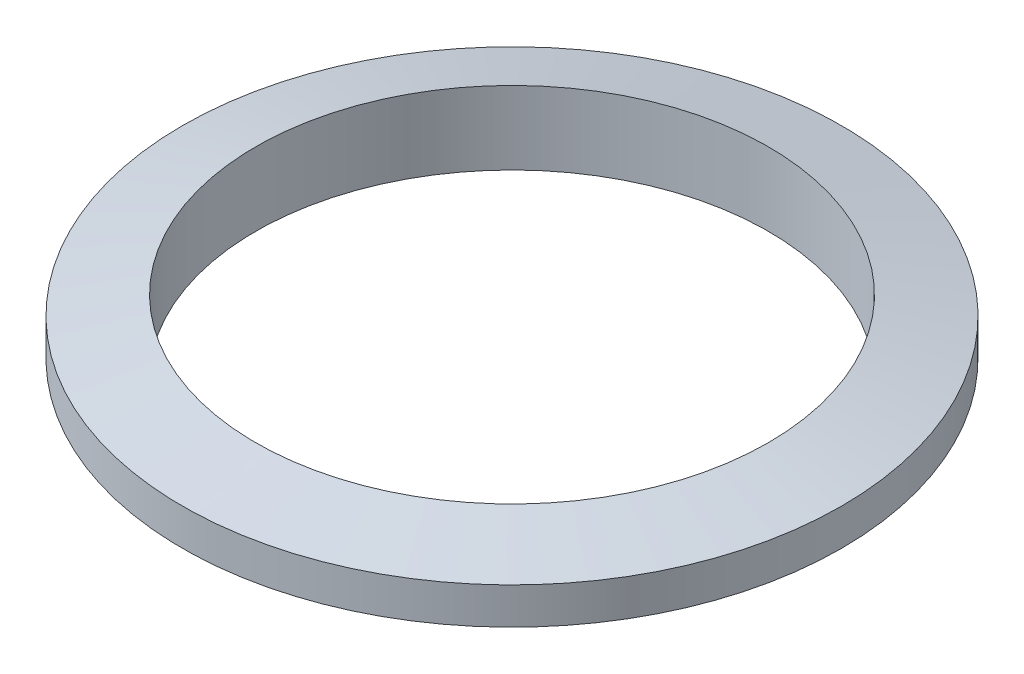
from build123d import *


with BuildPart() as part:
    # Sketch 1 → Revolve 1 (revolve)
    with BuildSketch(Plane.XY, mode=Mode.PRIVATE) as revolve_1_sk:
        Polygon((-9, 8.5), (-9, 9.5), (-7, 10), (-7, 8), align=None)
    revolve(revolve_1_sk.sketch.rotate(Axis((0, -4.108337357, 0), (0, 1, 0)), 180), axis=Axis((0, -4.108337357, 0), (0, 1, 0)))


solid = part.part
